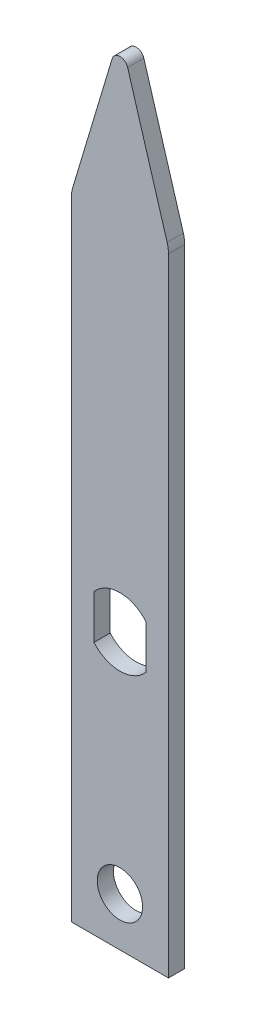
from build123d import *

# Parameters (mm, degrees)
EXTRUSION1_DEPTH = 5
EXTRUSION2_REACH = 247.51
ESQUISSE2_R      = 7
EXTRUSION3_REACH = 247.51
CONG_2_R         = 2.5
CONG_3_R         = 10


with BuildPart() as part:
    # Esquisse1 → Extrusion1 (new body)
    with BuildSketch(Plane.XY):
        Polygon((-15, 0), (-15, 195), (0, 245), (15, 195), (15, 0), align=None)
    extrude(amount=EXTRUSION1_DEPTH)

    # Esquisse2 → Extrusion2 (cut, up to next)
    with BuildSketch(Plane.XY.offset(5), mode=Mode.PRIVATE) as extrusion2_sk1:
        with Locations((0, 15)):
            Circle(ESQUISSE2_R)
    extrusion2_tool1 = extrude(extrusion2_sk1.sketch, amount=-EXTRUSION2_REACH, mode=Mode.PRIVATE) & part.part
    add(extrusion2_tool1.solids().sort_by_distance((0, 15, 5))[0], mode=Mode.SUBTRACT)

    # Esquisse3 → Extrusion3 (cut, up to next)
    with BuildSketch(Plane.XY.offset(5), mode=Mode.PRIVATE) as extrusion3_sk1:
        with BuildLine():
            Line((-8, 91.800735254), (-8, 78.199264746))
            ThreePointArc((-8, 78.199264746), (0, 74.5), (8, 78.199264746))
            Line((8, 78.199264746), (8, 91.800735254))
            ThreePointArc((8, 91.800735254), (0, 95.5), (-8, 91.800735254))
        make_face()
    extrusion3_tool1 = extrude(extrusion3_sk1.sketch, amount=-EXTRUSION3_REACH, mode=Mode.PRIVATE) & part.part
    add(extrusion3_tool1.solids().sort_by_distance((0, 85, 5))[0], mode=Mode.SUBTRACT)

    # Cong_2
    cong_2_edges = [part.edges().sort_by_distance(p)[0] for p in [
        (0, 245, 2.5),
    ]]
    fillet(cong_2_edges, radius=CONG_2_R)

    # Cong_3
    cong_3_edges = [part.edges().sort_by_distance(p)[0] for p in [
        (-15, 195, 2.5),
        (15, 195, 2.5),
    ]]
    fillet(cong_3_edges, radius=CONG_3_R)


solid = part.part
